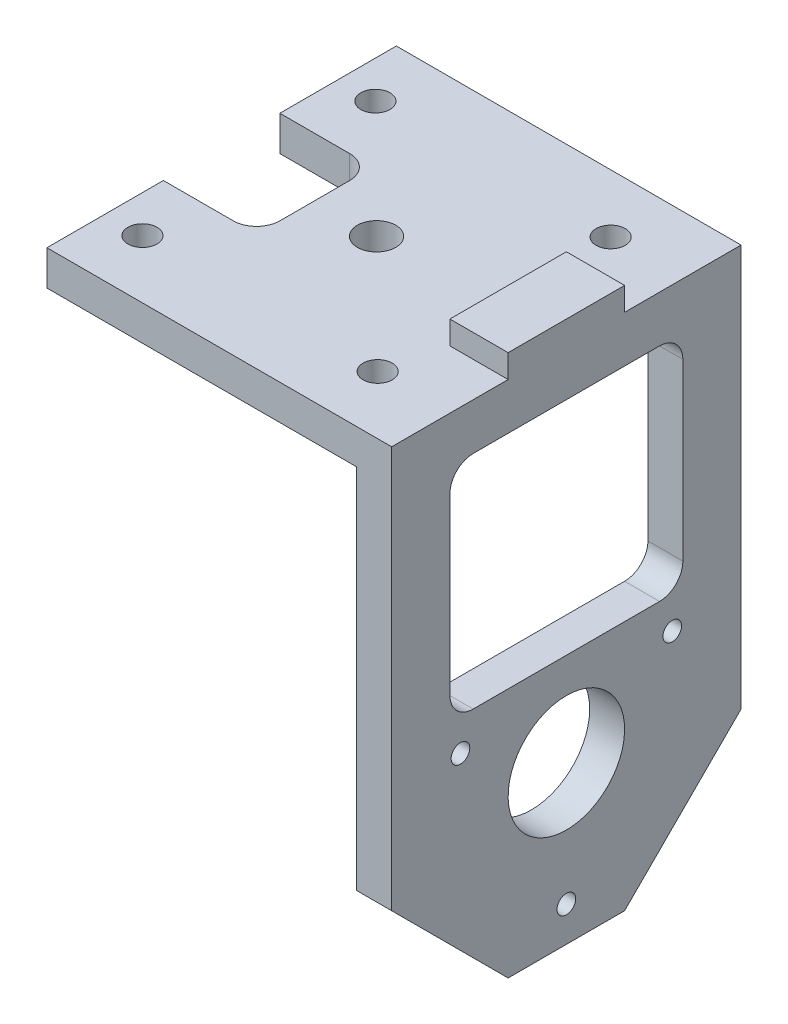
ISO-10303-21;
HEADER;
FILE_DESCRIPTION(('STEP AP214'),'2;1');
FILE_NAME('part.step','',(''),(''),'','','');
FILE_SCHEMA(('AUTOMOTIVE_DESIGN { 1 0 10303 214 1 1 1 1 }'));
ENDSEC;
DATA;
#1=APPLICATION_CONTEXT('core data for automotive mechanical design processes');
#2=APPLICATION_PROTOCOL_DEFINITION('international standard','automotive_design',2000,#1);
#3=PRODUCT_CONTEXT('',#1,'mechanical');
#4=PRODUCT('Part','Part','',(#3));
#5=PRODUCT_RELATED_PRODUCT_CATEGORY('part','',(#4));
#6=PRODUCT_DEFINITION_FORMATION('','',#4);
#7=PRODUCT_DEFINITION_CONTEXT('part definition',#1,'design');
#8=PRODUCT_DEFINITION('design','',#6,#7);
#9=PRODUCT_DEFINITION_SHAPE('','',#8);
#10=(LENGTH_UNIT() NAMED_UNIT(*) SI_UNIT(.MILLI.,.METRE.));
#11=(NAMED_UNIT(*) PLANE_ANGLE_UNIT() SI_UNIT($,.RADIAN.));
#12=(NAMED_UNIT(*) SI_UNIT($,.STERADIAN.) SOLID_ANGLE_UNIT());
#13=UNCERTAINTY_MEASURE_WITH_UNIT(LENGTH_MEASURE(1.E-05),#10,'distance_accuracy_value','');
#14=(GEOMETRIC_REPRESENTATION_CONTEXT(3) GLOBAL_UNCERTAINTY_ASSIGNED_CONTEXT((#13)) GLOBAL_UNIT_ASSIGNED_CONTEXT((#10,
#11,#12)) REPRESENTATION_CONTEXT('',''));
#15=CARTESIAN_POINT('',(0.,0.,0.));
#16=DIRECTION('',(0.,0.,1.));
#17=DIRECTION('',(1.,0.,0.));
#18=AXIS2_PLACEMENT_3D('',#15,#16,#17);
#19=CARTESIAN_POINT('',(0.,0.,-30.));
#20=DIRECTION('',(-1.,0.,0.));
#21=DIRECTION('',(0.,0.,1.));
#22=AXIS2_PLACEMENT_3D('',#19,#20,#21);
#23=PLANE('',#22);
#24=DIRECTION('',(0.,1.,0.));
#25=VECTOR('',#24,1.);
#26=CARTESIAN_POINT('',(0.,-43.001,-20.));
#27=LINE('',#26,#25);
#28=CARTESIAN_POINT('',(0.,0.,-20.));
#29=VERTEX_POINT('',#28);
#30=CARTESIAN_POINT('',(0.,3.,-20.));
#31=VERTEX_POINT('',#30);
#32=EDGE_CURVE('E226',#29,#31,#27,.T.);
#33=ORIENTED_EDGE('',*,*,#32,.T.);
#34=DIRECTION('',(0.,0.,1.));
#35=VECTOR('',#34,1.);
#36=CARTESIAN_POINT('',(0.,3.,-30.));
#37=LINE('',#36,#35);
#38=CARTESIAN_POINT('',(0.,3.,-30.));
#39=VERTEX_POINT('',#38);
#40=EDGE_CURVE('E249',#39,#31,#37,.T.);
#41=ORIENTED_EDGE('',*,*,#40,.F.);
#42=DIRECTION('',(0.,-1.,0.));
#43=VECTOR('',#42,1.);
#44=CARTESIAN_POINT('',(0.,0.,-30.));
#45=LINE('',#44,#43);
#46=CARTESIAN_POINT('',(0.,0.,-30.));
#47=VERTEX_POINT('',#46);
#48=EDGE_CURVE('E237',#39,#47,#45,.T.);
#49=ORIENTED_EDGE('',*,*,#48,.T.);
#50=DIRECTION('',(0.,0.,1.));
#51=VECTOR('',#50,1.);
#52=CARTESIAN_POINT('',(0.,0.,-30.));
#53=LINE('',#52,#51);
#54=EDGE_CURVE('E215',#47,#29,#53,.T.);
#55=ORIENTED_EDGE('',*,*,#54,.T.);
#56=EDGE_LOOP('',(#33,#41,#49,#55));
#57=FACE_BOUND('',#56,.T.);
#58=ADVANCED_FACE('F36',(#57),#23,.T.);
#59=DIRECTION('',(0.,1.,0.));
#60=VECTOR('',#59,1.);
#61=CARTESIAN_POINT('',(0.,-43.001,-10.));
#62=LINE('',#61,#60);
#63=CARTESIAN_POINT('',(0.,0.,-9.99999999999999));
#64=VERTEX_POINT('',#63);
#65=CARTESIAN_POINT('',(0.,3.,-10.));
#66=VERTEX_POINT('',#65);
#67=EDGE_CURVE('E233',#64,#66,#62,.T.);
#68=ORIENTED_EDGE('',*,*,#67,.F.);
#69=CARTESIAN_POINT('',(0.,0.,0.));
#70=VERTEX_POINT('',#69);
#71=EDGE_CURVE('E239',#64,#70,#53,.T.);
#72=ORIENTED_EDGE('',*,*,#71,.T.);
#73=DIRECTION('',(0.,-1.,0.));
#74=VECTOR('',#73,1.);
#75=CARTESIAN_POINT('',(0.,0.,0.));
#76=LINE('',#75,#74);
#77=CARTESIAN_POINT('',(0.,3.,0.));
#78=VERTEX_POINT('',#77);
#79=EDGE_CURVE('E304',#78,#70,#76,.T.);
#80=ORIENTED_EDGE('',*,*,#79,.F.);
#81=EDGE_CURVE('E287',#66,#78,#37,.T.);
#82=ORIENTED_EDGE('',*,*,#81,.F.);
#83=EDGE_LOOP('',(#68,#72,#80,#82));
#84=FACE_BOUND('',#83,.T.);
#85=ADVANCED_FACE('F515',(#84),#23,.T.);
#86=CARTESIAN_POINT('',(0.,3.,-30.));
#87=DIRECTION('',(0.,1.,0.));
#88=DIRECTION('',(0.,0.,1.));
#89=AXIS2_PLACEMENT_3D('',#86,#87,#88);
#90=PLANE('',#89);
#91=CARTESIAN_POINT('',(13.3000000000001,3.,-15.));
#92=DIRECTION('',(0.,1.,0.));
#93=DIRECTION('',(0.,0.,1.));
#94=AXIS2_PLACEMENT_3D('',#91,#92,#93);
#95=CIRCLE('',#94,1.65);
#96=CARTESIAN_POINT('',(13.3000000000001,3.,-13.35));
#97=VERTEX_POINT('',#96);
#98=EDGE_CURVE('E444',#97,#97,#95,.T.);
#99=ORIENTED_EDGE('',*,*,#98,.F.);
#100=EDGE_LOOP('',(#99));
#101=FACE_BOUND('',#100,.T.);
#102=CARTESIAN_POINT('',(23.4,3.,-5.));
#103=DIRECTION('',(0.,1.,0.));
#104=DIRECTION('',(0.,0.,1.));
#105=AXIS2_PLACEMENT_3D('',#102,#103,#104);
#106=CIRCLE('',#105,1.24999999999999);
#107=CARTESIAN_POINT('',(23.4,3.,-3.75000000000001));
#108=VERTEX_POINT('',#107);
#109=EDGE_CURVE('E441',#108,#108,#106,.T.);
#110=ORIENTED_EDGE('',*,*,#109,.F.);
#111=EDGE_LOOP('',(#110));
#112=FACE_BOUND('',#111,.T.);
#113=CARTESIAN_POINT('',(3.2,3.,-5.));
#114=DIRECTION('',(0.,1.,0.));
#115=DIRECTION('',(0.,0.,1.));
#116=AXIS2_PLACEMENT_3D('',#113,#114,#115);
#117=CIRCLE('',#116,1.24999999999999);
#118=CARTESIAN_POINT('',(3.2,3.,-3.75000000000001));
#119=VERTEX_POINT('',#118);
#120=EDGE_CURVE('E453',#119,#119,#117,.T.);
#121=ORIENTED_EDGE('',*,*,#120,.F.);
#122=EDGE_LOOP('',(#121));
#123=FACE_BOUND('',#122,.T.);
#124=CARTESIAN_POINT('',(23.4,3.,-25.));
#125=DIRECTION('',(0.,1.,0.));
#126=DIRECTION('',(0.,0.,1.));
#127=AXIS2_PLACEMENT_3D('',#124,#125,#126);
#128=CIRCLE('',#127,1.24999999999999);
#129=CARTESIAN_POINT('',(23.4,3.,-23.75));
#130=VERTEX_POINT('',#129);
#131=EDGE_CURVE('E459',#130,#130,#128,.T.);
#132=ORIENTED_EDGE('',*,*,#131,.F.);
#133=EDGE_LOOP('',(#132));
#134=FACE_BOUND('',#133,.T.);
#135=CARTESIAN_POINT('',(3.2,3.,-25.));
#136=DIRECTION('',(0.,1.,0.));
#137=DIRECTION('',(0.,0.,1.));
#138=AXIS2_PLACEMENT_3D('',#135,#136,#137);
#139=CIRCLE('',#138,1.24999999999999);
#140=CARTESIAN_POINT('',(3.2,3.,-23.75));
#141=VERTEX_POINT('',#140);
#142=EDGE_CURVE('E465',#141,#141,#139,.T.);
#143=ORIENTED_EDGE('',*,*,#142,.F.);
#144=EDGE_LOOP('',(#143));
#145=FACE_BOUND('',#144,.T.);
#146=DIRECTION('',(-1.,0.,0.));
#147=VECTOR('',#146,1.);
#148=CARTESIAN_POINT('',(0.,3.,-20.));
#149=LINE('',#148,#147);
#150=CARTESIAN_POINT('',(6.,3.,-20.));
#151=VERTEX_POINT('',#150);
#152=EDGE_CURVE('E229',#151,#31,#149,.T.);
#153=ORIENTED_EDGE('',*,*,#152,.F.);
#154=CARTESIAN_POINT('',(6.,3.,-18.));
#155=DIRECTION('',(0.,1.,0.));
#156=DIRECTION('',(0.,0.,1.));
#157=AXIS2_PLACEMENT_3D('',#154,#155,#156);
#158=CIRCLE('',#157,2.);
#159=CARTESIAN_POINT('',(8.,3.,-18.));
#160=VERTEX_POINT('',#159);
#161=EDGE_CURVE('E397',#151,#160,#158,.F.);
#162=ORIENTED_EDGE('',*,*,#161,.T.);
#163=DIRECTION('',(0.,0.,-1.));
#164=VECTOR('',#163,1.);
#165=CARTESIAN_POINT('',(8.,3.,-20.));
#166=LINE('',#165,#164);
#167=CARTESIAN_POINT('',(8.,3.,-12.));
#168=VERTEX_POINT('',#167);
#169=EDGE_CURVE('E474',#168,#160,#166,.T.);
#170=ORIENTED_EDGE('',*,*,#169,.F.);
#171=CARTESIAN_POINT('',(6.,3.,-12.));
#172=DIRECTION('',(0.,1.,0.));
#173=DIRECTION('',(0.,0.,1.));
#174=AXIS2_PLACEMENT_3D('',#171,#172,#173);
#175=CIRCLE('',#174,2.);
#176=CARTESIAN_POINT('',(6.,3.,-10.));
#177=VERTEX_POINT('',#176);
#178=EDGE_CURVE('E400',#168,#177,#175,.F.);
#179=ORIENTED_EDGE('',*,*,#178,.T.);
#180=DIRECTION('',(1.,0.,0.));
#181=VECTOR('',#180,1.);
#182=CARTESIAN_POINT('',(0.,3.,-10.));
#183=LINE('',#182,#181);
#184=EDGE_CURVE('E222',#66,#177,#183,.T.);
#185=ORIENTED_EDGE('',*,*,#184,.F.);
#186=ORIENTED_EDGE('',*,*,#81,.T.);
#187=DIRECTION('',(-1.,0.,0.));
#188=VECTOR('',#187,1.);
#189=CARTESIAN_POINT('',(0.,3.,0.));
#190=LINE('',#189,#188);
#191=CARTESIAN_POINT('',(29.6,3.,0.));
#192=VERTEX_POINT('',#191);
#193=EDGE_CURVE('E293',#192,#78,#190,.T.);
#194=ORIENTED_EDGE('',*,*,#193,.F.);
#195=DIRECTION('',(0.,0.,1.));
#196=VECTOR('',#195,1.);
#197=CARTESIAN_POINT('',(29.6,3.,-30.));
#198=LINE('',#197,#196);
#199=CARTESIAN_POINT('',(29.6,3.,-9.99999999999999));
#200=VERTEX_POINT('',#199);
#201=EDGE_CURVE('E241',#200,#192,#198,.T.);
#202=ORIENTED_EDGE('',*,*,#201,.F.);
#203=DIRECTION('',(1.,0.,0.));
#204=VECTOR('',#203,1.);
#205=CARTESIAN_POINT('',(29.6,3.,-10.));
#206=LINE('',#205,#204);
#207=CARTESIAN_POINT('',(24.6,3.,-10.));
#208=VERTEX_POINT('',#207);
#209=EDGE_CURVE('E377',#208,#200,#206,.T.);
#210=ORIENTED_EDGE('',*,*,#209,.F.);
#211=DIRECTION('',(0.,0.,1.));
#212=VECTOR('',#211,1.);
#213=CARTESIAN_POINT('',(24.6,3.,-20.));
#214=LINE('',#213,#212);
#215=CARTESIAN_POINT('',(24.6,3.,-20.));
#216=VERTEX_POINT('',#215);
#217=EDGE_CURVE('E374',#216,#208,#214,.T.);
#218=ORIENTED_EDGE('',*,*,#217,.F.);
#219=DIRECTION('',(-1.,0.,0.));
#220=VECTOR('',#219,1.);
#221=CARTESIAN_POINT('',(29.6,3.,-20.));
#222=LINE('',#221,#220);
#223=CARTESIAN_POINT('',(29.6,3.,-20.));
#224=VERTEX_POINT('',#223);
#225=EDGE_CURVE('E481',#224,#216,#222,.T.);
#226=ORIENTED_EDGE('',*,*,#225,.F.);
#227=CARTESIAN_POINT('',(29.6,3.,-30.));
#228=VERTEX_POINT('',#227);
#229=EDGE_CURVE('E284',#228,#224,#198,.T.);
#230=ORIENTED_EDGE('',*,*,#229,.F.);
#231=DIRECTION('',(-1.,0.,0.));
#232=VECTOR('',#231,1.);
#233=CARTESIAN_POINT('',(0.,3.,-30.));
#234=LINE('',#233,#232);
#235=EDGE_CURVE('E243',#228,#39,#234,.T.);
#236=ORIENTED_EDGE('',*,*,#235,.T.);
#237=ORIENTED_EDGE('',*,*,#40,.T.);
#238=EDGE_LOOP('',(#153,#162,#170,#179,#185,#186,#194,#202,#210,#218,#226,#230,#236,#237));
#239=FACE_BOUND('',#238,.T.);
#240=ADVANCED_FACE('F508',(#101,#112,#123,#134,#145,#239),#90,.T.);
#241=CARTESIAN_POINT('',(29.6,3.,-30.));
#242=DIRECTION('',(1.,0.,0.));
#243=DIRECTION('',(0.,1.,0.));
#244=AXIS2_PLACEMENT_3D('',#241,#242,#243);
#245=PLANE('',#244);
#246=DIRECTION('',(0.,1.,0.));
#247=VECTOR('',#246,1.);
#248=CARTESIAN_POINT('',(29.6,3.,0.));
#249=LINE('',#248,#247);
#250=CARTESIAN_POINT('',(29.6,-31.5,0.));
#251=VERTEX_POINT('',#250);
#252=EDGE_CURVE('E296',#251,#192,#249,.T.);
#253=ORIENTED_EDGE('',*,*,#252,.F.);
#254=DIRECTION('',(0.,0.707106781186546,0.707106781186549));
#255=VECTOR('',#254,1.);
#256=CARTESIAN_POINT('',(29.6,-29.25,2.24999999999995));
#257=LINE('',#256,#255);
#258=CARTESIAN_POINT('',(29.6,-41.5,-10.));
#259=VERTEX_POINT('',#258);
#260=EDGE_CURVE('E409',#251,#259,#257,.F.);
#261=ORIENTED_EDGE('',*,*,#260,.T.);
#262=DIRECTION('',(0.,0.,1.));
#263=VECTOR('',#262,1.);
#264=CARTESIAN_POINT('',(29.6,-41.5,2.36973964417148));
#265=LINE('',#264,#263);
#266=CARTESIAN_POINT('',(29.6,-41.5,-20.));
#267=VERTEX_POINT('',#266);
#268=EDGE_CURVE('E434',#267,#259,#265,.T.);
#269=ORIENTED_EDGE('',*,*,#268,.F.);
#270=DIRECTION('',(0.,0.707106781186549,-0.707106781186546));
#271=VECTOR('',#270,1.);
#272=CARTESIAN_POINT('',(29.6,-14.2499999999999,-47.25));
#273=LINE('',#272,#271);
#274=CARTESIAN_POINT('',(29.6,-31.5,-30.));
#275=VERTEX_POINT('',#274);
#276=EDGE_CURVE('E407',#267,#275,#273,.T.);
#277=ORIENTED_EDGE('',*,*,#276,.T.);
#278=DIRECTION('',(0.,1.,0.));
#279=VECTOR('',#278,1.);
#280=CARTESIAN_POINT('',(29.6,3.,-30.));
#281=LINE('',#280,#279);
#282=EDGE_CURVE('E310',#275,#228,#281,.T.);
#283=ORIENTED_EDGE('',*,*,#282,.T.);
#284=ORIENTED_EDGE('',*,*,#229,.T.);
#285=DIRECTION('',(0.,-1.,0.));
#286=VECTOR('',#285,1.);
#287=CARTESIAN_POINT('',(29.6,5.,-20.));
#288=LINE('',#287,#286);
#289=CARTESIAN_POINT('',(29.6,5.,-20.));
#290=VERTEX_POINT('',#289);
#291=EDGE_CURVE('E364',#290,#224,#288,.T.);
#292=ORIENTED_EDGE('',*,*,#291,.F.);
#293=DIRECTION('',(0.,0.,-1.));
#294=VECTOR('',#293,1.);
#295=CARTESIAN_POINT('',(29.6,5.,-20.));
#296=LINE('',#295,#294);
#297=CARTESIAN_POINT('',(29.6,5.,-10.));
#298=VERTEX_POINT('',#297);
#299=EDGE_CURVE('E381',#298,#290,#296,.T.);
#300=ORIENTED_EDGE('',*,*,#299,.F.);
#301=DIRECTION('',(0.,-1.,0.));
#302=VECTOR('',#301,1.);
#303=CARTESIAN_POINT('',(29.6,5.,-10.));
#304=LINE('',#303,#302);
#305=EDGE_CURVE('E371',#298,#200,#304,.T.);
#306=ORIENTED_EDGE('',*,*,#305,.T.);
#307=ORIENTED_EDGE('',*,*,#201,.T.);
#308=EDGE_LOOP('',(#253,#261,#269,#277,#283,#284,#292,#300,#306,#307));
#309=FACE_BOUND('',#308,.T.);
#310=CARTESIAN_POINT('',(29.6,-22.7500000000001,-5.90673326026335));
#311=DIRECTION('',(1.,0.,0.));
#312=DIRECTION('',(0.,0.,-1.));
#313=AXIS2_PLACEMENT_3D('',#310,#311,#312);
#314=CIRCLE('',#313,0.799999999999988);
#315=CARTESIAN_POINT('',(29.6,-22.7500000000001,-6.70673326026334));
#316=VERTEX_POINT('',#315);
#317=EDGE_CURVE('E361',#316,#316,#314,.T.);
#318=ORIENTED_EDGE('',*,*,#317,.F.);
#319=EDGE_LOOP('',(#318));
#320=FACE_BOUND('',#319,.T.);
#321=CARTESIAN_POINT('',(29.6,-22.75,-24.0932667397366));
#322=DIRECTION('',(1.,0.,0.));
#323=DIRECTION('',(0.,0.,-1.));
#324=AXIS2_PLACEMENT_3D('',#321,#322,#323);
#325=CIRCLE('',#324,0.799999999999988);
#326=CARTESIAN_POINT('',(29.6,-22.75,-24.8932667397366));
#327=VERTEX_POINT('',#326);
#328=EDGE_CURVE('E355',#327,#327,#325,.T.);
#329=ORIENTED_EDGE('',*,*,#328,.F.);
#330=EDGE_LOOP('',(#329));
#331=FACE_BOUND('',#330,.T.);
#332=CARTESIAN_POINT('',(29.6,-38.5,-15.));
#333=DIRECTION('',(1.,0.,0.));
#334=DIRECTION('',(0.,0.,-1.));
#335=AXIS2_PLACEMENT_3D('',#332,#333,#334);
#336=CIRCLE('',#335,0.799999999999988);
#337=CARTESIAN_POINT('',(29.6,-38.5,-15.8));
#338=VERTEX_POINT('',#337);
#339=EDGE_CURVE('E349',#338,#338,#336,.T.);
#340=ORIENTED_EDGE('',*,*,#339,.F.);
#341=EDGE_LOOP('',(#340));
#342=FACE_BOUND('',#341,.T.);
#343=CARTESIAN_POINT('',(29.6,-28.,-15.));
#344=DIRECTION('',(1.,0.,0.));
#345=DIRECTION('',(0.,1.,0.));
#346=AXIS2_PLACEMENT_3D('',#343,#344,#345);
#347=CIRCLE('',#346,5.);
#348=CARTESIAN_POINT('',(29.6,-23.,-15.));
#349=VERTEX_POINT('',#348);
#350=EDGE_CURVE('E340',#349,#349,#347,.T.);
#351=ORIENTED_EDGE('',*,*,#350,.F.);
#352=EDGE_LOOP('',(#351));
#353=FACE_BOUND('',#352,.T.);
#354=DIRECTION('',(0.,1.,0.));
#355=VECTOR('',#354,1.);
#356=CARTESIAN_POINT('',(29.6,0.,-25.));
#357=LINE('',#356,#355);
#358=CARTESIAN_POINT('',(29.6,-18.,-25.));
#359=VERTEX_POINT('',#358);
#360=CARTESIAN_POINT('',(29.6,-3.,-25.));
#361=VERTEX_POINT('',#360);
#362=EDGE_CURVE('E328',#359,#361,#357,.T.);
#363=ORIENTED_EDGE('',*,*,#362,.F.);
#364=CARTESIAN_POINT('',(29.6,-18.,-23.));
#365=DIRECTION('',(1.,0.,0.));
#366=DIRECTION('',(0.,1.,0.));
#367=AXIS2_PLACEMENT_3D('',#364,#365,#366);
#368=CIRCLE('',#367,2.);
#369=CARTESIAN_POINT('',(29.6,-20.,-23.));
#370=VERTEX_POINT('',#369);
#371=EDGE_CURVE('E267',#359,#370,#368,.F.);
#372=ORIENTED_EDGE('',*,*,#371,.T.);
#373=DIRECTION('',(0.,0.,-1.));
#374=VECTOR('',#373,1.);
#375=CARTESIAN_POINT('',(29.6,-20.,0.));
#376=LINE('',#375,#374);
#377=CARTESIAN_POINT('',(29.6,-20.,-7.));
#378=VERTEX_POINT('',#377);
#379=EDGE_CURVE('E319',#378,#370,#376,.T.);
#380=ORIENTED_EDGE('',*,*,#379,.F.);
#381=CARTESIAN_POINT('',(29.6,-18.,-7.));
#382=DIRECTION('',(1.,0.,0.));
#383=DIRECTION('',(0.,1.,0.));
#384=AXIS2_PLACEMENT_3D('',#381,#382,#383);
#385=CIRCLE('',#384,2.);
#386=CARTESIAN_POINT('',(29.6,-18.,-5.));
#387=VERTEX_POINT('',#386);
#388=EDGE_CURVE('E271',#378,#387,#385,.F.);
#389=ORIENTED_EDGE('',*,*,#388,.T.);
#390=DIRECTION('',(0.,1.,0.));
#391=VECTOR('',#390,1.);
#392=CARTESIAN_POINT('',(29.6,0.,-5.));
#393=LINE('',#392,#391);
#394=CARTESIAN_POINT('',(29.6,-3.,-5.));
#395=VERTEX_POINT('',#394);
#396=EDGE_CURVE('E322',#387,#395,#393,.T.);
#397=ORIENTED_EDGE('',*,*,#396,.T.);
#398=CARTESIAN_POINT('',(29.6,-3.,-7.));
#399=DIRECTION('',(1.,0.,0.));
#400=DIRECTION('',(0.,1.,0.));
#401=AXIS2_PLACEMENT_3D('',#398,#399,#400);
#402=CIRCLE('',#401,2.);
#403=CARTESIAN_POINT('',(29.6,-1.,-7.));
#404=VERTEX_POINT('',#403);
#405=EDGE_CURVE('E275',#395,#404,#402,.F.);
#406=ORIENTED_EDGE('',*,*,#405,.T.);
#407=DIRECTION('',(0.,0.,1.));
#408=VECTOR('',#407,1.);
#409=CARTESIAN_POINT('',(29.6,-1.,0.));
#410=LINE('',#409,#408);
#411=CARTESIAN_POINT('',(29.6,-0.999999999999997,-23.));
#412=VERTEX_POINT('',#411);
#413=EDGE_CURVE('E325',#412,#404,#410,.T.);
#414=ORIENTED_EDGE('',*,*,#413,.F.);
#415=CARTESIAN_POINT('',(29.6,-3.,-23.));
#416=DIRECTION('',(1.,0.,0.));
#417=DIRECTION('',(0.,1.,0.));
#418=AXIS2_PLACEMENT_3D('',#415,#416,#417);
#419=CIRCLE('',#418,2.);
#420=EDGE_CURVE('E279',#412,#361,#419,.F.);
#421=ORIENTED_EDGE('',*,*,#420,.T.);
#422=EDGE_LOOP('',(#363,#372,#380,#389,#397,#406,#414,#421));
#423=FACE_BOUND('',#422,.T.);
#424=ADVANCED_FACE('F432',(#309,#320,#331,#342,#353,#423),#245,.T.);
#425=CARTESIAN_POINT('',(26.6,0.,-30.));
#426=DIRECTION('',(-1.,0.,0.));
#427=DIRECTION('',(0.,-1.,0.));
#428=AXIS2_PLACEMENT_3D('',#425,#426,#427);
#429=PLANE('',#428);
#430=DIRECTION('',(0.,0.,-1.));
#431=VECTOR('',#430,1.);
#432=CARTESIAN_POINT('',(26.6,-41.5,-30.));
#433=LINE('',#432,#431);
#434=CARTESIAN_POINT('',(26.6,-41.5,-10.0000000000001));
#435=VERTEX_POINT('',#434);
#436=CARTESIAN_POINT('',(26.6,-41.5,-20.));
#437=VERTEX_POINT('',#436);
#438=EDGE_CURVE('E420',#435,#437,#433,.T.);
#439=ORIENTED_EDGE('',*,*,#438,.F.);
#440=DIRECTION('',(0.,-0.707106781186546,-0.707106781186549));
#441=VECTOR('',#440,1.);
#442=CARTESIAN_POINT('',(26.6,-30.75,0.749999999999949));
#443=LINE('',#442,#441);
#444=CARTESIAN_POINT('',(26.6,-31.5,0.));
#445=VERTEX_POINT('',#444);
#446=EDGE_CURVE('E44',#435,#445,#443,.F.);
#447=ORIENTED_EDGE('',*,*,#446,.T.);
#448=DIRECTION('',(0.,-1.,0.));
#449=VECTOR('',#448,1.);
#450=CARTESIAN_POINT('',(26.6,0.,0.));
#451=LINE('',#450,#449);
#452=CARTESIAN_POINT('',(26.6,0.,0.));
#453=VERTEX_POINT('',#452);
#454=EDGE_CURVE('E298',#453,#445,#451,.T.);
#455=ORIENTED_EDGE('',*,*,#454,.F.);
#456=DIRECTION('',(0.,0.,1.));
#457=VECTOR('',#456,1.);
#458=CARTESIAN_POINT('',(26.6,0.,-30.));
#459=LINE('',#458,#457);
#460=CARTESIAN_POINT('',(26.6,0.,-30.));
#461=VERTEX_POINT('',#460);
#462=EDGE_CURVE('E238',#461,#453,#459,.T.);
#463=ORIENTED_EDGE('',*,*,#462,.F.);
#464=DIRECTION('',(0.,-1.,0.));
#465=VECTOR('',#464,1.);
#466=CARTESIAN_POINT('',(26.6,0.,-30.));
#467=LINE('',#466,#465);
#468=CARTESIAN_POINT('',(26.6,-31.5,-30.));
#469=VERTEX_POINT('',#468);
#470=EDGE_CURVE('E312',#461,#469,#467,.T.);
#471=ORIENTED_EDGE('',*,*,#470,.T.);
#472=DIRECTION('',(0.,-0.707106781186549,0.707106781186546));
#473=VECTOR('',#472,1.);
#474=CARTESIAN_POINT('',(26.6,-15.7499999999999,-45.75));
#475=LINE('',#474,#473);
#476=EDGE_CURVE('E56',#469,#437,#475,.T.);
#477=ORIENTED_EDGE('',*,*,#476,.T.);
#478=EDGE_LOOP('',(#439,#447,#455,#463,#471,#477));
#479=FACE_BOUND('',#478,.T.);
#480=CARTESIAN_POINT('',(26.6,-22.7500000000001,-5.90673326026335));
#481=DIRECTION('',(-1.,0.,0.));
#482=DIRECTION('',(0.,-1.,0.));
#483=AXIS2_PLACEMENT_3D('',#480,#481,#482);
#484=CIRCLE('',#483,0.799999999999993);
#485=CARTESIAN_POINT('',(26.6,-23.5500000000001,-5.90673326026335));
#486=VERTEX_POINT('',#485);
#487=EDGE_CURVE('E358',#486,#486,#484,.T.);
#488=ORIENTED_EDGE('',*,*,#487,.F.);
#489=EDGE_LOOP('',(#488));
#490=FACE_BOUND('',#489,.T.);
#491=CARTESIAN_POINT('',(26.6,-22.75,-24.0932667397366));
#492=DIRECTION('',(-1.,0.,0.));
#493=DIRECTION('',(0.,-1.,0.));
#494=AXIS2_PLACEMENT_3D('',#491,#492,#493);
#495=CIRCLE('',#494,0.799999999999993);
#496=CARTESIAN_POINT('',(26.6,-23.55,-24.0932667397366));
#497=VERTEX_POINT('',#496);
#498=EDGE_CURVE('E352',#497,#497,#495,.T.);
#499=ORIENTED_EDGE('',*,*,#498,.F.);
#500=EDGE_LOOP('',(#499));
#501=FACE_BOUND('',#500,.T.);
#502=CARTESIAN_POINT('',(26.6,-38.5,-15.));
#503=DIRECTION('',(-1.,0.,0.));
#504=DIRECTION('',(0.,-1.,0.));
#505=AXIS2_PLACEMENT_3D('',#502,#503,#504);
#506=CIRCLE('',#505,0.799999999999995);
#507=CARTESIAN_POINT('',(26.6,-39.3,-15.));
#508=VERTEX_POINT('',#507);
#509=EDGE_CURVE('E344',#508,#508,#506,.T.);
#510=ORIENTED_EDGE('',*,*,#509,.F.);
#511=EDGE_LOOP('',(#510));
#512=FACE_BOUND('',#511,.T.);
#513=CARTESIAN_POINT('',(26.6,-28.,-15.));
#514=DIRECTION('',(-1.,0.,0.));
#515=DIRECTION('',(0.,-1.,0.));
#516=AXIS2_PLACEMENT_3D('',#513,#514,#515);
#517=CIRCLE('',#516,5.);
#518=CARTESIAN_POINT('',(26.6,-33.,-15.));
#519=VERTEX_POINT('',#518);
#520=EDGE_CURVE('E341',#519,#519,#517,.F.);
#521=ORIENTED_EDGE('',*,*,#520,.T.);
#522=EDGE_LOOP('',(#521));
#523=FACE_BOUND('',#522,.T.);
#524=DIRECTION('',(0.,0.,-1.));
#525=VECTOR('',#524,1.);
#526=CARTESIAN_POINT('',(26.6,-20.,0.));
#527=LINE('',#526,#525);
#528=CARTESIAN_POINT('',(26.6,-20.,-7.));
#529=VERTEX_POINT('',#528);
#530=CARTESIAN_POINT('',(26.6,-20.,-23.));
#531=VERTEX_POINT('',#530);
#532=EDGE_CURVE('E334',#529,#531,#527,.T.);
#533=ORIENTED_EDGE('',*,*,#532,.T.);
#534=CARTESIAN_POINT('',(26.6,-18.,-23.));
#535=DIRECTION('',(-1.,0.,0.));
#536=DIRECTION('',(0.,-1.,0.));
#537=AXIS2_PLACEMENT_3D('',#534,#535,#536);
#538=CIRCLE('',#537,2.);
#539=CARTESIAN_POINT('',(26.6,-18.,-25.));
#540=VERTEX_POINT('',#539);
#541=EDGE_CURVE('E269',#531,#540,#538,.F.);
#542=ORIENTED_EDGE('',*,*,#541,.T.);
#543=DIRECTION('',(0.,1.,0.));
#544=VECTOR('',#543,1.);
#545=CARTESIAN_POINT('',(26.6,0.,-25.));
#546=LINE('',#545,#544);
#547=CARTESIAN_POINT('',(26.6,-3.,-25.));
#548=VERTEX_POINT('',#547);
#549=EDGE_CURVE('E331',#540,#548,#546,.T.);
#550=ORIENTED_EDGE('',*,*,#549,.T.);
#551=CARTESIAN_POINT('',(26.6,-3.,-23.));
#552=DIRECTION('',(-1.,0.,0.));
#553=DIRECTION('',(0.,-1.,0.));
#554=AXIS2_PLACEMENT_3D('',#551,#552,#553);
#555=CIRCLE('',#554,2.);
#556=CARTESIAN_POINT('',(26.6,-0.999999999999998,-23.));
#557=VERTEX_POINT('',#556);
#558=EDGE_CURVE('E281',#548,#557,#555,.F.);
#559=ORIENTED_EDGE('',*,*,#558,.T.);
#560=DIRECTION('',(0.,0.,1.));
#561=VECTOR('',#560,1.);
#562=CARTESIAN_POINT('',(26.6,-1.,0.));
#563=LINE('',#562,#561);
#564=CARTESIAN_POINT('',(26.6,-1.,-7.));
#565=VERTEX_POINT('',#564);
#566=EDGE_CURVE('E307',#557,#565,#563,.T.);
#567=ORIENTED_EDGE('',*,*,#566,.T.);
#568=CARTESIAN_POINT('',(26.6,-3.,-7.));
#569=DIRECTION('',(-1.,0.,0.));
#570=DIRECTION('',(0.,-1.,0.));
#571=AXIS2_PLACEMENT_3D('',#568,#569,#570);
#572=CIRCLE('',#571,2.);
#573=CARTESIAN_POINT('',(26.6,-3.,-5.));
#574=VERTEX_POINT('',#573);
#575=EDGE_CURVE('E277',#565,#574,#572,.F.);
#576=ORIENTED_EDGE('',*,*,#575,.T.);
#577=DIRECTION('',(0.,1.,0.));
#578=VECTOR('',#577,1.);
#579=CARTESIAN_POINT('',(26.6,0.,-5.));
#580=LINE('',#579,#578);
#581=CARTESIAN_POINT('',(26.6,-18.,-5.));
#582=VERTEX_POINT('',#581);
#583=EDGE_CURVE('E337',#582,#574,#580,.T.);
#584=ORIENTED_EDGE('',*,*,#583,.F.);
#585=CARTESIAN_POINT('',(26.6,-18.,-7.));
#586=DIRECTION('',(-1.,0.,0.));
#587=DIRECTION('',(0.,-1.,0.));
#588=AXIS2_PLACEMENT_3D('',#585,#586,#587);
#589=CIRCLE('',#588,2.);
#590=EDGE_CURVE('E273',#582,#529,#589,.F.);
#591=ORIENTED_EDGE('',*,*,#590,.T.);
#592=EDGE_LOOP('',(#533,#542,#550,#559,#567,#576,#584,#591));
#593=FACE_BOUND('',#592,.T.);
#594=ADVANCED_FACE('F418',(#479,#490,#501,#512,#523,#593),#429,.T.);
#595=CARTESIAN_POINT('',(0.,0.,-30.));
#596=DIRECTION('',(0.,-1.,0.));
#597=DIRECTION('',(0.,0.,-1.));
#598=AXIS2_PLACEMENT_3D('',#595,#596,#597);
#599=PLANE('',#598);
#600=CARTESIAN_POINT('',(13.3000000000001,0.,-15.));
#601=DIRECTION('',(0.,-1.,0.));
#602=DIRECTION('',(0.,0.,-1.));
#603=AXIS2_PLACEMENT_3D('',#600,#601,#602);
#604=CIRCLE('',#603,1.65);
#605=CARTESIAN_POINT('',(13.3000000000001,0.,-16.65));
#606=VERTEX_POINT('',#605);
#607=EDGE_CURVE('E439',#606,#606,#604,.T.);
#608=ORIENTED_EDGE('',*,*,#607,.F.);
#609=EDGE_LOOP('',(#608));
#610=FACE_BOUND('',#609,.T.);
#611=CARTESIAN_POINT('',(23.4,0.,-5.));
#612=DIRECTION('',(0.,-1.,0.));
#613=DIRECTION('',(0.,0.,-1.));
#614=AXIS2_PLACEMENT_3D('',#611,#612,#613);
#615=CIRCLE('',#614,1.24999999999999);
#616=CARTESIAN_POINT('',(23.4,0.,-6.24999999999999));
#617=VERTEX_POINT('',#616);
#618=EDGE_CURVE('E450',#617,#617,#615,.T.);
#619=ORIENTED_EDGE('',*,*,#618,.F.);
#620=EDGE_LOOP('',(#619));
#621=FACE_BOUND('',#620,.T.);
#622=CARTESIAN_POINT('',(3.2,0.,-5.));
#623=DIRECTION('',(0.,-1.,0.));
#624=DIRECTION('',(0.,0.,-1.));
#625=AXIS2_PLACEMENT_3D('',#622,#623,#624);
#626=CIRCLE('',#625,1.24999999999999);
#627=CARTESIAN_POINT('',(3.2,0.,-6.24999999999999));
#628=VERTEX_POINT('',#627);
#629=EDGE_CURVE('E456',#628,#628,#626,.T.);
#630=ORIENTED_EDGE('',*,*,#629,.F.);
#631=EDGE_LOOP('',(#630));
#632=FACE_BOUND('',#631,.T.);
#633=CARTESIAN_POINT('',(23.4,0.,-25.));
#634=DIRECTION('',(0.,-1.,0.));
#635=DIRECTION('',(0.,0.,-1.));
#636=AXIS2_PLACEMENT_3D('',#633,#634,#635);
#637=CIRCLE('',#636,1.24999999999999);
#638=CARTESIAN_POINT('',(23.4,0.,-26.25));
#639=VERTEX_POINT('',#638);
#640=EDGE_CURVE('E462',#639,#639,#637,.T.);
#641=ORIENTED_EDGE('',*,*,#640,.F.);
#642=EDGE_LOOP('',(#641));
#643=FACE_BOUND('',#642,.T.);
#644=CARTESIAN_POINT('',(3.2,0.,-25.));
#645=DIRECTION('',(0.,-1.,0.));
#646=DIRECTION('',(0.,0.,-1.));
#647=AXIS2_PLACEMENT_3D('',#644,#645,#646);
#648=CIRCLE('',#647,1.24999999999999);
#649=CARTESIAN_POINT('',(3.2,0.,-26.25));
#650=VERTEX_POINT('',#649);
#651=EDGE_CURVE('E468',#650,#650,#648,.T.);
#652=ORIENTED_EDGE('',*,*,#651,.F.);
#653=EDGE_LOOP('',(#652));
#654=FACE_BOUND('',#653,.T.);
#655=DIRECTION('',(0.,0.,-1.));
#656=VECTOR('',#655,1.);
#657=CARTESIAN_POINT('',(8.,0.,-20.));
#658=LINE('',#657,#656);
#659=CARTESIAN_POINT('',(8.,0.,-12.));
#660=VERTEX_POINT('',#659);
#661=CARTESIAN_POINT('',(8.,0.,-18.));
#662=VERTEX_POINT('',#661);
#663=EDGE_CURVE('E223',#660,#662,#658,.T.);
#664=ORIENTED_EDGE('',*,*,#663,.T.);
#665=CARTESIAN_POINT('',(6.,0.,-18.));
#666=DIRECTION('',(0.,-1.,0.));
#667=DIRECTION('',(0.,0.,-1.));
#668=AXIS2_PLACEMENT_3D('',#665,#666,#667);
#669=CIRCLE('',#668,2.);
#670=CARTESIAN_POINT('',(6.,0.,-20.));
#671=VERTEX_POINT('',#670);
#672=EDGE_CURVE('E218',#662,#671,#669,.F.);
#673=ORIENTED_EDGE('',*,*,#672,.T.);
#674=DIRECTION('',(-1.,0.,0.));
#675=VECTOR('',#674,1.);
#676=CARTESIAN_POINT('',(0.,0.,-20.));
#677=LINE('',#676,#675);
#678=EDGE_CURVE('E209',#671,#29,#677,.T.);
#679=ORIENTED_EDGE('',*,*,#678,.T.);
#680=ORIENTED_EDGE('',*,*,#54,.F.);
#681=DIRECTION('',(1.,0.,0.));
#682=VECTOR('',#681,1.);
#683=CARTESIAN_POINT('',(0.,0.,-30.));
#684=LINE('',#683,#682);
#685=EDGE_CURVE('E314',#47,#461,#684,.T.);
#686=ORIENTED_EDGE('',*,*,#685,.T.);
#687=ORIENTED_EDGE('',*,*,#462,.T.);
#688=DIRECTION('',(1.,0.,0.));
#689=VECTOR('',#688,1.);
#690=CARTESIAN_POINT('',(0.,0.,0.));
#691=LINE('',#690,#689);
#692=EDGE_CURVE('E301',#70,#453,#691,.T.);
#693=ORIENTED_EDGE('',*,*,#692,.F.);
#694=ORIENTED_EDGE('',*,*,#71,.F.);
#695=DIRECTION('',(1.,0.,0.));
#696=VECTOR('',#695,1.);
#697=CARTESIAN_POINT('',(0.,0.,-10.));
#698=LINE('',#697,#696);
#699=CARTESIAN_POINT('',(6.,0.,-10.));
#700=VERTEX_POINT('',#699);
#701=EDGE_CURVE('E232',#64,#700,#698,.T.);
#702=ORIENTED_EDGE('',*,*,#701,.T.);
#703=CARTESIAN_POINT('',(6.,0.,-12.));
#704=DIRECTION('',(0.,-1.,0.));
#705=DIRECTION('',(0.,0.,-1.));
#706=AXIS2_PLACEMENT_3D('',#703,#704,#705);
#707=CIRCLE('',#706,2.);
#708=EDGE_CURVE('E402',#700,#660,#707,.F.);
#709=ORIENTED_EDGE('',*,*,#708,.T.);
#710=EDGE_LOOP('',(#664,#673,#679,#680,#686,#687,#693,#694,#702,#709));
#711=FACE_BOUND('',#710,.T.);
#712=ADVANCED_FACE('F212',(#610,#621,#632,#643,#654,#711),#599,.T.);
#713=CARTESIAN_POINT('',(0.,0.,-30.));
#714=DIRECTION('',(0.,0.,-1.));
#715=DIRECTION('',(-1.,0.,0.));
#716=AXIS2_PLACEMENT_3D('',#713,#714,#715);
#717=PLANE('',#716);
#718=ORIENTED_EDGE('',*,*,#282,.F.);
#719=DIRECTION('',(-1.,0.,0.));
#720=VECTOR('',#719,1.);
#721=CARTESIAN_POINT('',(26.6,-31.5,-30.));
#722=LINE('',#721,#720);
#723=EDGE_CURVE('E11',#275,#469,#722,.T.);
#724=ORIENTED_EDGE('',*,*,#723,.T.);
#725=ORIENTED_EDGE('',*,*,#470,.F.);
#726=ORIENTED_EDGE('',*,*,#685,.F.);
#727=ORIENTED_EDGE('',*,*,#48,.F.);
#728=ORIENTED_EDGE('',*,*,#235,.F.);
#729=EDGE_LOOP('',(#718,#724,#725,#726,#727,#728));
#730=FACE_BOUND('',#729,.T.);
#731=ADVANCED_FACE('F517',(#730),#717,.T.);
#732=CARTESIAN_POINT('',(0.,0.,0.));
#733=DIRECTION('',(0.,0.,-1.));
#734=DIRECTION('',(-1.,0.,0.));
#735=AXIS2_PLACEMENT_3D('',#732,#733,#734);
#736=PLANE('',#735);
#737=ORIENTED_EDGE('',*,*,#454,.T.);
#738=DIRECTION('',(1.,0.,0.));
#739=VECTOR('',#738,1.);
#740=CARTESIAN_POINT('',(0.,-31.5,0.));
#741=LINE('',#740,#739);
#742=EDGE_CURVE('E404',#445,#251,#741,.T.);
#743=ORIENTED_EDGE('',*,*,#742,.T.);
#744=ORIENTED_EDGE('',*,*,#252,.T.);
#745=ORIENTED_EDGE('',*,*,#193,.T.);
#746=ORIENTED_EDGE('',*,*,#79,.T.);
#747=ORIENTED_EDGE('',*,*,#692,.T.);
#748=EDGE_LOOP('',(#737,#743,#744,#745,#746,#747));
#749=FACE_BOUND('',#748,.T.);
#750=ADVANCED_FACE('F425',(#749),#736,.F.);
#751=CARTESIAN_POINT('',(-0.00100000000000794,0.,-25.));
#752=DIRECTION('',(0.,0.,-1.));
#753=DIRECTION('',(-1.,0.,0.));
#754=AXIS2_PLACEMENT_3D('',#751,#752,#753);
#755=PLANE('',#754);
#756=ORIENTED_EDGE('',*,*,#549,.F.);
#757=DIRECTION('',(1.,0.,0.));
#758=VECTOR('',#757,1.);
#759=CARTESIAN_POINT('',(29.6,-18.,-25.));
#760=LINE('',#759,#758);
#761=EDGE_CURVE('E248',#540,#359,#760,.T.);
#762=ORIENTED_EDGE('',*,*,#761,.T.);
#763=ORIENTED_EDGE('',*,*,#362,.T.);
#764=DIRECTION('',(1.,0.,0.));
#765=VECTOR('',#764,1.);
#766=CARTESIAN_POINT('',(26.6,-3.,-25.));
#767=LINE('',#766,#765);
#768=EDGE_CURVE('E246',#361,#548,#767,.F.);
#769=ORIENTED_EDGE('',*,*,#768,.T.);
#770=EDGE_LOOP('',(#756,#762,#763,#769));
#771=FACE_BOUND('',#770,.T.);
#772=ADVANCED_FACE('F596',(#771),#755,.F.);
#773=CARTESIAN_POINT('',(-0.00100000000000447,-20.,0.));
#774=DIRECTION('',(0.,-1.,0.));
#775=DIRECTION('',(1.,0.,0.));
#776=AXIS2_PLACEMENT_3D('',#773,#774,#775);
#777=PLANE('',#776);
#778=ORIENTED_EDGE('',*,*,#379,.T.);
#779=DIRECTION('',(1.,0.,0.));
#780=VECTOR('',#779,1.);
#781=CARTESIAN_POINT('',(26.6,-20.,-23.));
#782=LINE('',#781,#780);
#783=EDGE_CURVE('E255',#370,#531,#782,.F.);
#784=ORIENTED_EDGE('',*,*,#783,.T.);
#785=ORIENTED_EDGE('',*,*,#532,.F.);
#786=DIRECTION('',(1.,0.,0.));
#787=VECTOR('',#786,1.);
#788=CARTESIAN_POINT('',(-0.00100000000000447,-20.,-7.));
#789=LINE('',#788,#787);
#790=EDGE_CURVE('E252',#529,#378,#789,.T.);
#791=ORIENTED_EDGE('',*,*,#790,.T.);
#792=EDGE_LOOP('',(#778,#784,#785,#791));
#793=FACE_BOUND('',#792,.T.);
#794=ADVANCED_FACE('F591',(#793),#777,.F.);
#795=CARTESIAN_POINT('',(-0.00100000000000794,0.,-5.));
#796=DIRECTION('',(0.,0.,-1.));
#797=DIRECTION('',(-1.,0.,0.));
#798=AXIS2_PLACEMENT_3D('',#795,#796,#797);
#799=PLANE('',#798);
#800=ORIENTED_EDGE('',*,*,#396,.F.);
#801=DIRECTION('',(1.,0.,0.));
#802=VECTOR('',#801,1.);
#803=CARTESIAN_POINT('',(-0.00100000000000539,-18.,-5.));
#804=LINE('',#803,#802);
#805=EDGE_CURVE('E260',#387,#582,#804,.F.);
#806=ORIENTED_EDGE('',*,*,#805,.T.);
#807=ORIENTED_EDGE('',*,*,#583,.T.);
#808=DIRECTION('',(1.,0.,0.));
#809=VECTOR('',#808,1.);
#810=CARTESIAN_POINT('',(-0.00100000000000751,-3.,-5.));
#811=LINE('',#810,#809);
#812=EDGE_CURVE('E257',#574,#395,#811,.T.);
#813=ORIENTED_EDGE('',*,*,#812,.T.);
#814=EDGE_LOOP('',(#800,#806,#807,#813));
#815=FACE_BOUND('',#814,.T.);
#816=ADVANCED_FACE('F585',(#815),#799,.T.);
#817=CARTESIAN_POINT('',(-0.00100000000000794,-1.,0.));
#818=DIRECTION('',(0.,1.,0.));
#819=DIRECTION('',(-1.,0.,0.));
#820=AXIS2_PLACEMENT_3D('',#817,#818,#819);
#821=PLANE('',#820);
#822=ORIENTED_EDGE('',*,*,#413,.T.);
#823=DIRECTION('',(1.,0.,0.));
#824=VECTOR('',#823,1.);
#825=CARTESIAN_POINT('',(-0.00100000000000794,-1.,-7.));
#826=LINE('',#825,#824);
#827=EDGE_CURVE('E265',#404,#565,#826,.F.);
#828=ORIENTED_EDGE('',*,*,#827,.T.);
#829=ORIENTED_EDGE('',*,*,#566,.F.);
#830=DIRECTION('',(1.,0.,0.));
#831=VECTOR('',#830,1.);
#832=CARTESIAN_POINT('',(29.6,-0.999999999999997,-23.));
#833=LINE('',#832,#831);
#834=EDGE_CURVE('E262',#557,#412,#833,.T.);
#835=ORIENTED_EDGE('',*,*,#834,.T.);
#836=EDGE_LOOP('',(#822,#828,#829,#835));
#837=FACE_BOUND('',#836,.T.);
#838=ADVANCED_FACE('F577',(#837),#821,.F.);
#839=CARTESIAN_POINT('',(-0.00100000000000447,-28.,-15.));
#840=DIRECTION('',(1.,0.,0.));
#841=DIRECTION('',(0.,1.,0.));
#842=AXIS2_PLACEMENT_3D('',#839,#840,#841);
#843=CYLINDRICAL_SURFACE('',#842,5.);
#844=ORIENTED_EDGE('',*,*,#520,.F.);
#845=EDGE_LOOP('',(#844));
#846=FACE_BOUND('',#845,.T.);
#847=ORIENTED_EDGE('',*,*,#350,.T.);
#848=EDGE_LOOP('',(#847));
#849=FACE_BOUND('',#848,.T.);
#850=ADVANCED_FACE('F616',(#846,#849),#843,.F.);
#851=CARTESIAN_POINT('',(29.6,-38.5,-15.));
#852=DIRECTION('',(1.,0.,0.));
#853=DIRECTION('',(0.,0.,-1.));
#854=AXIS2_PLACEMENT_3D('',#851,#852,#853);
#855=CYLINDRICAL_SURFACE('',#854,0.799999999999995);
#856=ORIENTED_EDGE('',*,*,#339,.T.);
#857=EDGE_LOOP('',(#856));
#858=FACE_BOUND('',#857,.T.);
#859=ORIENTED_EDGE('',*,*,#509,.T.);
#860=EDGE_LOOP('',(#859));
#861=FACE_BOUND('',#860,.T.);
#862=ADVANCED_FACE('F623',(#858,#861),#855,.F.);
#863=CARTESIAN_POINT('',(29.6,-22.75,-24.0932667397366));
#864=DIRECTION('',(1.,0.,0.));
#865=DIRECTION('',(0.,0.,-1.));
#866=AXIS2_PLACEMENT_3D('',#863,#864,#865);
#867=CYLINDRICAL_SURFACE('',#866,0.799999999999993);
#868=ORIENTED_EDGE('',*,*,#328,.T.);
#869=EDGE_LOOP('',(#868));
#870=FACE_BOUND('',#869,.T.);
#871=ORIENTED_EDGE('',*,*,#498,.T.);
#872=EDGE_LOOP('',(#871));
#873=FACE_BOUND('',#872,.T.);
#874=ADVANCED_FACE('F627',(#870,#873),#867,.F.);
#875=CARTESIAN_POINT('',(29.6,-22.7500000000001,-5.90673326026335));
#876=DIRECTION('',(1.,0.,0.));
#877=DIRECTION('',(0.,0.,-1.));
#878=AXIS2_PLACEMENT_3D('',#875,#876,#877);
#879=CYLINDRICAL_SURFACE('',#878,0.799999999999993);
#880=ORIENTED_EDGE('',*,*,#317,.T.);
#881=EDGE_LOOP('',(#880));
#882=FACE_BOUND('',#881,.T.);
#883=ORIENTED_EDGE('',*,*,#487,.T.);
#884=EDGE_LOOP('',(#883));
#885=FACE_BOUND('',#884,.T.);
#886=ADVANCED_FACE('F553',(#882,#885),#879,.F.);
#887=CARTESIAN_POINT('',(-0.00100000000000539,-18.,-23.));
#888=DIRECTION('',(-1.,0.,0.));
#889=DIRECTION('',(0.,-1.,0.));
#890=AXIS2_PLACEMENT_3D('',#887,#888,#889);
#891=CYLINDRICAL_SURFACE('',#890,2.);
#892=ORIENTED_EDGE('',*,*,#541,.F.);
#893=ORIENTED_EDGE('',*,*,#783,.F.);
#894=ORIENTED_EDGE('',*,*,#371,.F.);
#895=ORIENTED_EDGE('',*,*,#761,.F.);
#896=EDGE_LOOP('',(#892,#893,#894,#895));
#897=FACE_BOUND('',#896,.T.);
#898=ADVANCED_FACE('F549',(#897),#891,.F.);
#899=CARTESIAN_POINT('',(-0.00100000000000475,-18.,-7.));
#900=DIRECTION('',(1.,0.,0.));
#901=DIRECTION('',(0.,1.,0.));
#902=AXIS2_PLACEMENT_3D('',#899,#900,#901);
#903=CYLINDRICAL_SURFACE('',#902,2.);
#904=ORIENTED_EDGE('',*,*,#590,.F.);
#905=ORIENTED_EDGE('',*,*,#805,.F.);
#906=ORIENTED_EDGE('',*,*,#388,.F.);
#907=ORIENTED_EDGE('',*,*,#790,.F.);
#908=EDGE_LOOP('',(#904,#905,#906,#907));
#909=FACE_BOUND('',#908,.T.);
#910=ADVANCED_FACE('F552',(#909),#903,.F.);
#911=CARTESIAN_POINT('',(-0.00100000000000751,-3.,-7.));
#912=DIRECTION('',(1.,0.,0.));
#913=DIRECTION('',(0.,1.,0.));
#914=AXIS2_PLACEMENT_3D('',#911,#912,#913);
#915=CYLINDRICAL_SURFACE('',#914,2.);
#916=ORIENTED_EDGE('',*,*,#575,.F.);
#917=ORIENTED_EDGE('',*,*,#827,.F.);
#918=ORIENTED_EDGE('',*,*,#405,.F.);
#919=ORIENTED_EDGE('',*,*,#812,.F.);
#920=EDGE_LOOP('',(#916,#917,#918,#919));
#921=FACE_BOUND('',#920,.T.);
#922=ADVANCED_FACE('F557',(#921),#915,.F.);
#923=CARTESIAN_POINT('',(-0.00100000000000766,-3.,-23.));
#924=DIRECTION('',(-1.,0.,0.));
#925=DIRECTION('',(0.,-1.,0.));
#926=AXIS2_PLACEMENT_3D('',#923,#924,#925);
#927=CYLINDRICAL_SURFACE('',#926,2.);
#928=ORIENTED_EDGE('',*,*,#558,.F.);
#929=ORIENTED_EDGE('',*,*,#768,.F.);
#930=ORIENTED_EDGE('',*,*,#420,.F.);
#931=ORIENTED_EDGE('',*,*,#834,.F.);
#932=EDGE_LOOP('',(#928,#929,#930,#931));
#933=FACE_BOUND('',#932,.T.);
#934=ADVANCED_FACE('F560',(#933),#927,.F.);
#935=CARTESIAN_POINT('',(29.6,5.,-20.));
#936=DIRECTION('',(0.,0.,1.));
#937=DIRECTION('',(1.,0.,0.));
#938=AXIS2_PLACEMENT_3D('',#935,#936,#937);
#939=PLANE('',#938);
#940=ORIENTED_EDGE('',*,*,#225,.T.);
#941=DIRECTION('',(0.,-1.,0.));
#942=VECTOR('',#941,1.);
#943=CARTESIAN_POINT('',(24.6,5.,-20.));
#944=LINE('',#943,#942);
#945=CARTESIAN_POINT('',(24.6,5.,-20.));
#946=VERTEX_POINT('',#945);
#947=EDGE_CURVE('E365',#946,#216,#944,.T.);
#948=ORIENTED_EDGE('',*,*,#947,.F.);
#949=DIRECTION('',(-1.,0.,0.));
#950=VECTOR('',#949,1.);
#951=CARTESIAN_POINT('',(29.6,5.,-20.));
#952=LINE('',#951,#950);
#953=EDGE_CURVE('E484',#290,#946,#952,.T.);
#954=ORIENTED_EDGE('',*,*,#953,.F.);
#955=ORIENTED_EDGE('',*,*,#291,.T.);
#956=EDGE_LOOP('',(#940,#948,#954,#955));
#957=FACE_BOUND('',#956,.T.);
#958=ADVANCED_FACE('F563',(#957),#939,.F.);
#959=CARTESIAN_POINT('',(24.6,5.,-20.));
#960=DIRECTION('',(1.,0.,0.));
#961=DIRECTION('',(0.,0.,-1.));
#962=AXIS2_PLACEMENT_3D('',#959,#960,#961);
#963=PLANE('',#962);
#964=ORIENTED_EDGE('',*,*,#217,.T.);
#965=DIRECTION('',(0.,-1.,0.));
#966=VECTOR('',#965,1.);
#967=CARTESIAN_POINT('',(24.6,5.,-10.));
#968=LINE('',#967,#966);
#969=CARTESIAN_POINT('',(24.6,5.,-10.));
#970=VERTEX_POINT('',#969);
#971=EDGE_CURVE('E368',#970,#208,#968,.T.);
#972=ORIENTED_EDGE('',*,*,#971,.F.);
#973=DIRECTION('',(0.,0.,1.));
#974=VECTOR('',#973,1.);
#975=CARTESIAN_POINT('',(24.6,5.,-20.));
#976=LINE('',#975,#974);
#977=EDGE_CURVE('E486',#946,#970,#976,.T.);
#978=ORIENTED_EDGE('',*,*,#977,.F.);
#979=ORIENTED_EDGE('',*,*,#947,.T.);
#980=EDGE_LOOP('',(#964,#972,#978,#979));
#981=FACE_BOUND('',#980,.T.);
#982=ADVANCED_FACE('F506',(#981),#963,.F.);
#983=CARTESIAN_POINT('',(29.6,5.,-10.));
#984=DIRECTION('',(0.,0.,-1.));
#985=DIRECTION('',(-1.,0.,0.));
#986=AXIS2_PLACEMENT_3D('',#983,#984,#985);
#987=PLANE('',#986);
#988=ORIENTED_EDGE('',*,*,#209,.T.);
#989=ORIENTED_EDGE('',*,*,#305,.F.);
#990=DIRECTION('',(1.,0.,0.));
#991=VECTOR('',#990,1.);
#992=CARTESIAN_POINT('',(29.6,5.,-10.));
#993=LINE('',#992,#991);
#994=EDGE_CURVE('E386',#970,#298,#993,.T.);
#995=ORIENTED_EDGE('',*,*,#994,.F.);
#996=ORIENTED_EDGE('',*,*,#971,.T.);
#997=EDGE_LOOP('',(#988,#989,#995,#996));
#998=FACE_BOUND('',#997,.T.);
#999=ADVANCED_FACE('F496',(#998),#987,.F.);
#1000=CARTESIAN_POINT('',(0.,5.,0.));
#1001=DIRECTION('',(0.,-1.,0.));
#1002=DIRECTION('',(0.,0.,-1.));
#1003=AXIS2_PLACEMENT_3D('',#1000,#1001,#1002);
#1004=PLANE('',#1003);
#1005=ORIENTED_EDGE('',*,*,#299,.T.);
#1006=ORIENTED_EDGE('',*,*,#953,.T.);
#1007=ORIENTED_EDGE('',*,*,#977,.T.);
#1008=ORIENTED_EDGE('',*,*,#994,.T.);
#1009=EDGE_LOOP('',(#1005,#1006,#1007,#1008));
#1010=FACE_BOUND('',#1009,.T.);
#1011=ADVANCED_FACE('F490',(#1010),#1004,.F.);
#1012=CARTESIAN_POINT('',(0.,-43.001,-20.));
#1013=DIRECTION('',(0.,0.,-1.));
#1014=DIRECTION('',(-1.,0.,0.));
#1015=AXIS2_PLACEMENT_3D('',#1012,#1013,#1014);
#1016=PLANE('',#1015);
#1017=ORIENTED_EDGE('',*,*,#678,.F.);
#1018=DIRECTION('',(0.,1.,0.));
#1019=VECTOR('',#1018,1.);
#1020=CARTESIAN_POINT('',(6.,3.,-20.));
#1021=LINE('',#1020,#1019);
#1022=EDGE_CURVE('E283',#671,#151,#1021,.T.);
#1023=ORIENTED_EDGE('',*,*,#1022,.T.);
#1024=ORIENTED_EDGE('',*,*,#152,.T.);
#1025=ORIENTED_EDGE('',*,*,#32,.F.);
#1026=EDGE_LOOP('',(#1017,#1023,#1024,#1025));
#1027=FACE_BOUND('',#1026,.T.);
#1028=ADVANCED_FACE('F227',(#1027),#1016,.F.);
#1029=CARTESIAN_POINT('',(8.,-43.001,-20.));
#1030=DIRECTION('',(1.,0.,0.));
#1031=DIRECTION('',(0.,0.,-1.));
#1032=AXIS2_PLACEMENT_3D('',#1029,#1030,#1031);
#1033=PLANE('',#1032);
#1034=ORIENTED_EDGE('',*,*,#169,.T.);
#1035=DIRECTION('',(0.,1.,0.));
#1036=VECTOR('',#1035,1.);
#1037=CARTESIAN_POINT('',(8.,0.,-18.));
#1038=LINE('',#1037,#1036);
#1039=EDGE_CURVE('E393',#160,#662,#1038,.F.);
#1040=ORIENTED_EDGE('',*,*,#1039,.T.);
#1041=ORIENTED_EDGE('',*,*,#663,.F.);
#1042=DIRECTION('',(0.,1.,0.));
#1043=VECTOR('',#1042,1.);
#1044=CARTESIAN_POINT('',(8.,3.,-12.));
#1045=LINE('',#1044,#1043);
#1046=EDGE_CURVE('E390',#660,#168,#1045,.T.);
#1047=ORIENTED_EDGE('',*,*,#1046,.T.);
#1048=EDGE_LOOP('',(#1034,#1040,#1041,#1047));
#1049=FACE_BOUND('',#1048,.T.);
#1050=ADVANCED_FACE('F523',(#1049),#1033,.F.);
#1051=CARTESIAN_POINT('',(0.,-43.001,-10.));
#1052=DIRECTION('',(0.,0.,1.));
#1053=DIRECTION('',(1.,0.,0.));
#1054=AXIS2_PLACEMENT_3D('',#1051,#1052,#1053);
#1055=PLANE('',#1054);
#1056=ORIENTED_EDGE('',*,*,#184,.T.);
#1057=DIRECTION('',(0.,1.,0.));
#1058=VECTOR('',#1057,1.);
#1059=CARTESIAN_POINT('',(6.,0.,-10.));
#1060=LINE('',#1059,#1058);
#1061=EDGE_CURVE('E395',#177,#700,#1060,.F.);
#1062=ORIENTED_EDGE('',*,*,#1061,.T.);
#1063=ORIENTED_EDGE('',*,*,#701,.F.);
#1064=ORIENTED_EDGE('',*,*,#67,.T.);
#1065=EDGE_LOOP('',(#1056,#1062,#1063,#1064));
#1066=FACE_BOUND('',#1065,.T.);
#1067=ADVANCED_FACE('F641',(#1066),#1055,.F.);
#1068=CARTESIAN_POINT('',(3.2,3.,-25.));
#1069=DIRECTION('',(0.,1.,0.));
#1070=DIRECTION('',(0.,0.,1.));
#1071=AXIS2_PLACEMENT_3D('',#1068,#1069,#1070);
#1072=CYLINDRICAL_SURFACE('',#1071,1.24999999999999);
#1073=ORIENTED_EDGE('',*,*,#142,.T.);
#1074=EDGE_LOOP('',(#1073));
#1075=FACE_BOUND('',#1074,.T.);
#1076=ORIENTED_EDGE('',*,*,#651,.T.);
#1077=EDGE_LOOP('',(#1076));
#1078=FACE_BOUND('',#1077,.T.);
#1079=ADVANCED_FACE('F644',(#1075,#1078),#1072,.F.);
#1080=CARTESIAN_POINT('',(23.4,3.,-25.));
#1081=DIRECTION('',(0.,1.,0.));
#1082=DIRECTION('',(0.,0.,1.));
#1083=AXIS2_PLACEMENT_3D('',#1080,#1081,#1082);
#1084=CYLINDRICAL_SURFACE('',#1083,1.24999999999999);
#1085=ORIENTED_EDGE('',*,*,#131,.T.);
#1086=EDGE_LOOP('',(#1085));
#1087=FACE_BOUND('',#1086,.T.);
#1088=ORIENTED_EDGE('',*,*,#640,.T.);
#1089=EDGE_LOOP('',(#1088));
#1090=FACE_BOUND('',#1089,.T.);
#1091=ADVANCED_FACE('F652',(#1087,#1090),#1084,.F.);
#1092=CARTESIAN_POINT('',(3.2,3.,-5.));
#1093=DIRECTION('',(0.,1.,0.));
#1094=DIRECTION('',(0.,0.,1.));
#1095=AXIS2_PLACEMENT_3D('',#1092,#1093,#1094);
#1096=CYLINDRICAL_SURFACE('',#1095,1.24999999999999);
#1097=ORIENTED_EDGE('',*,*,#120,.T.);
#1098=EDGE_LOOP('',(#1097));
#1099=FACE_BOUND('',#1098,.T.);
#1100=ORIENTED_EDGE('',*,*,#629,.T.);
#1101=EDGE_LOOP('',(#1100));
#1102=FACE_BOUND('',#1101,.T.);
#1103=ADVANCED_FACE('F537',(#1099,#1102),#1096,.F.);
#1104=CARTESIAN_POINT('',(23.4,3.,-5.));
#1105=DIRECTION('',(0.,1.,0.));
#1106=DIRECTION('',(0.,0.,1.));
#1107=AXIS2_PLACEMENT_3D('',#1104,#1105,#1106);
#1108=CYLINDRICAL_SURFACE('',#1107,1.24999999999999);
#1109=ORIENTED_EDGE('',*,*,#109,.T.);
#1110=EDGE_LOOP('',(#1109));
#1111=FACE_BOUND('',#1110,.T.);
#1112=ORIENTED_EDGE('',*,*,#618,.T.);
#1113=EDGE_LOOP('',(#1112));
#1114=FACE_BOUND('',#1113,.T.);
#1115=ADVANCED_FACE('F529',(#1111,#1114),#1108,.F.);
#1116=CARTESIAN_POINT('',(6.,-43.001,-18.));
#1117=DIRECTION('',(0.,-1.,0.));
#1118=DIRECTION('',(0.,0.,-1.));
#1119=AXIS2_PLACEMENT_3D('',#1116,#1117,#1118);
#1120=CYLINDRICAL_SURFACE('',#1119,2.);
#1121=ORIENTED_EDGE('',*,*,#672,.F.);
#1122=ORIENTED_EDGE('',*,*,#1039,.F.);
#1123=ORIENTED_EDGE('',*,*,#161,.F.);
#1124=ORIENTED_EDGE('',*,*,#1022,.F.);
#1125=EDGE_LOOP('',(#1121,#1122,#1123,#1124));
#1126=FACE_BOUND('',#1125,.T.);
#1127=ADVANCED_FACE('F526',(#1126),#1120,.F.);
#1128=CARTESIAN_POINT('',(6.,-43.001,-12.));
#1129=DIRECTION('',(0.,-1.,0.));
#1130=DIRECTION('',(0.,0.,-1.));
#1131=AXIS2_PLACEMENT_3D('',#1128,#1129,#1130);
#1132=CYLINDRICAL_SURFACE('',#1131,2.);
#1133=ORIENTED_EDGE('',*,*,#708,.F.);
#1134=ORIENTED_EDGE('',*,*,#1061,.F.);
#1135=ORIENTED_EDGE('',*,*,#178,.F.);
#1136=ORIENTED_EDGE('',*,*,#1046,.F.);
#1137=EDGE_LOOP('',(#1133,#1134,#1135,#1136));
#1138=FACE_BOUND('',#1137,.T.);
#1139=ADVANCED_FACE('F528',(#1138),#1132,.F.);
#1140=CARTESIAN_POINT('',(19.6,-41.5,2.36973964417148));
#1141=DIRECTION('',(0.,1.,0.));
#1142=DIRECTION('',(-1.,0.,0.));
#1143=AXIS2_PLACEMENT_3D('',#1140,#1141,#1142);
#1144=PLANE('',#1143);
#1145=ORIENTED_EDGE('',*,*,#268,.T.);
#1146=DIRECTION('',(-1.,0.,0.));
#1147=VECTOR('',#1146,1.);
#1148=CARTESIAN_POINT('',(19.6,-41.5,-10.));
#1149=LINE('',#1148,#1147);
#1150=EDGE_CURVE('E414',#259,#435,#1149,.T.);
#1151=ORIENTED_EDGE('',*,*,#1150,.T.);
#1152=ORIENTED_EDGE('',*,*,#438,.T.);
#1153=DIRECTION('',(1.,0.,0.));
#1154=VECTOR('',#1153,1.);
#1155=CARTESIAN_POINT('',(29.6,-41.5,-20.));
#1156=LINE('',#1155,#1154);
#1157=EDGE_CURVE('E411',#437,#267,#1156,.T.);
#1158=ORIENTED_EDGE('',*,*,#1157,.T.);
#1159=EDGE_LOOP('',(#1145,#1151,#1152,#1158));
#1160=FACE_BOUND('',#1159,.T.);
#1161=ADVANCED_FACE('F437',(#1160),#1144,.F.);
#1162=CARTESIAN_POINT('',(0.,-31.5,0.));
#1163=DIRECTION('',(0.,0.707106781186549,-0.707106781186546));
#1164=DIRECTION('',(1.,0.,0.));
#1165=AXIS2_PLACEMENT_3D('',#1162,#1163,#1164);
#1166=PLANE('',#1165);
#1167=ORIENTED_EDGE('',*,*,#446,.F.);
#1168=ORIENTED_EDGE('',*,*,#1150,.F.);
#1169=ORIENTED_EDGE('',*,*,#260,.F.);
#1170=ORIENTED_EDGE('',*,*,#742,.F.);
#1171=EDGE_LOOP('',(#1167,#1168,#1169,#1170));
#1172=FACE_BOUND('',#1171,.T.);
#1173=ADVANCED_FACE('F428',(#1172),#1166,.F.);
#1174=CARTESIAN_POINT('',(19.6,-41.5,-20.));
#1175=DIRECTION('',(0.,-0.707106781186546,-0.707106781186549));
#1176=DIRECTION('',(-1.,0.,0.));
#1177=AXIS2_PLACEMENT_3D('',#1174,#1175,#1176);
#1178=PLANE('',#1177);
#1179=ORIENTED_EDGE('',*,*,#476,.F.);
#1180=ORIENTED_EDGE('',*,*,#723,.F.);
#1181=ORIENTED_EDGE('',*,*,#276,.F.);
#1182=ORIENTED_EDGE('',*,*,#1157,.F.);
#1183=EDGE_LOOP('',(#1179,#1180,#1181,#1182));
#1184=FACE_BOUND('',#1183,.T.);
#1185=ADVANCED_FACE('F38',(#1184),#1178,.T.);
#1186=CARTESIAN_POINT('',(13.3000000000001,3.,-15.));
#1187=DIRECTION('',(0.,1.,0.));
#1188=DIRECTION('',(0.,0.,1.));
#1189=AXIS2_PLACEMENT_3D('',#1186,#1187,#1188);
#1190=CYLINDRICAL_SURFACE('',#1189,1.65);
#1191=ORIENTED_EDGE('',*,*,#607,.T.);
#1192=EDGE_LOOP('',(#1191));
#1193=FACE_BOUND('',#1192,.T.);
#1194=ORIENTED_EDGE('',*,*,#98,.T.);
#1195=EDGE_LOOP('',(#1194));
#1196=FACE_BOUND('',#1195,.T.);
#1197=ADVANCED_FACE('F662',(#1193,#1196),#1190,.F.);
#1198=CLOSED_SHELL('',(#58,#85,#240,#424,#594,#712,#731,#750,#772,#794,#816,#838,#850,#862,#874,
#886,#898,#910,#922,#934,#958,#982,#999,#1011,#1028,#1050,#1067,#1079,#1091,#1103,#1115,#1127,
#1139,#1161,#1173,#1185,#1197));
#1199=MANIFOLD_SOLID_BREP('B2',#1198);
#1200=ADVANCED_BREP_SHAPE_REPRESENTATION('',(#18,#1199),#14);
#1201=SHAPE_DEFINITION_REPRESENTATION(#9,#1200);
ENDSEC;
END-ISO-10303-21;
